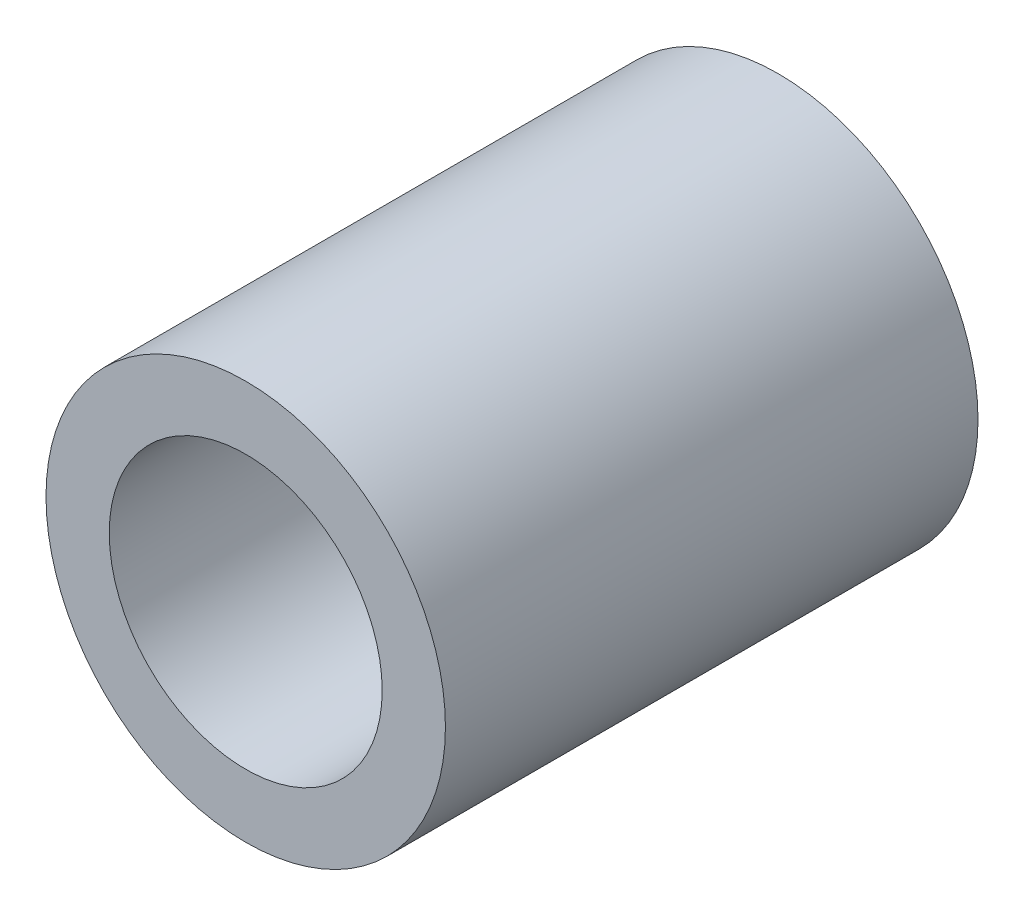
ISO-10303-21;
HEADER;
FILE_DESCRIPTION(('STEP AP214'),'2;1');
FILE_NAME('part.step','',(''),(''),'','','');
FILE_SCHEMA(('AUTOMOTIVE_DESIGN { 1 0 10303 214 1 1 1 1 }'));
ENDSEC;
DATA;
#1=APPLICATION_CONTEXT('core data for automotive mechanical design processes');
#2=APPLICATION_PROTOCOL_DEFINITION('international standard','automotive_design',2000,#1);
#3=PRODUCT_CONTEXT('',#1,'mechanical');
#4=PRODUCT('Part','Part','',(#3));
#5=PRODUCT_RELATED_PRODUCT_CATEGORY('part','',(#4));
#6=PRODUCT_DEFINITION_FORMATION('','',#4);
#7=PRODUCT_DEFINITION_CONTEXT('part definition',#1,'design');
#8=PRODUCT_DEFINITION('design','',#6,#7);
#9=PRODUCT_DEFINITION_SHAPE('','',#8);
#10=(LENGTH_UNIT() NAMED_UNIT(*) SI_UNIT(.MILLI.,.METRE.));
#11=(NAMED_UNIT(*) PLANE_ANGLE_UNIT() SI_UNIT($,.RADIAN.));
#12=(NAMED_UNIT(*) SI_UNIT($,.STERADIAN.) SOLID_ANGLE_UNIT());
#13=UNCERTAINTY_MEASURE_WITH_UNIT(LENGTH_MEASURE(1.E-05),#10,'distance_accuracy_value','');
#14=(GEOMETRIC_REPRESENTATION_CONTEXT(3) GLOBAL_UNCERTAINTY_ASSIGNED_CONTEXT((#13)) GLOBAL_UNIT_ASSIGNED_CONTEXT((#10,
#11,#12)) REPRESENTATION_CONTEXT('',''));
#15=CARTESIAN_POINT('',(0.,0.,0.));
#16=DIRECTION('',(0.,0.,1.));
#17=DIRECTION('',(1.,0.,0.));
#18=AXIS2_PLACEMENT_3D('',#15,#16,#17);
#19=CARTESIAN_POINT('',(0.,0.,40.));
#20=DIRECTION('',(0.,0.,1.));
#21=DIRECTION('',(1.,0.,0.));
#22=AXIS2_PLACEMENT_3D('',#19,#20,#21);
#23=PLANE('',#22);
#24=CARTESIAN_POINT('',(0.,0.,40.));
#25=DIRECTION('',(0.,0.,1.));
#26=DIRECTION('',(1.,0.,0.));
#27=AXIS2_PLACEMENT_3D('',#24,#25,#26);
#28=CIRCLE('',#27,15.);
#29=CARTESIAN_POINT('',(15.,0.,40.));
#30=VERTEX_POINT('',#29);
#31=EDGE_CURVE('E10',#30,#30,#28,.T.);
#32=ORIENTED_EDGE('',*,*,#31,.T.);
#33=EDGE_LOOP('',(#32));
#34=FACE_BOUND('',#33,.T.);
#35=CARTESIAN_POINT('',(0.,0.,40.));
#36=DIRECTION('',(0.,0.,1.));
#37=DIRECTION('',(1.,0.,0.));
#38=AXIS2_PLACEMENT_3D('',#35,#36,#37);
#39=CIRCLE('',#38,10.25);
#40=CARTESIAN_POINT('',(10.25,0.,40.));
#41=VERTEX_POINT('',#40);
#42=EDGE_CURVE('E44',#41,#41,#39,.T.);
#43=ORIENTED_EDGE('',*,*,#42,.F.);
#44=EDGE_LOOP('',(#43));
#45=FACE_BOUND('',#44,.T.);
#46=ADVANCED_FACE('F27',(#34,#45),#23,.T.);
#47=CARTESIAN_POINT('',(0.,0.,0.));
#48=DIRECTION('',(0.,0.,1.));
#49=DIRECTION('',(1.,0.,0.));
#50=AXIS2_PLACEMENT_3D('',#47,#48,#49);
#51=PLANE('',#50);
#52=CARTESIAN_POINT('',(0.,0.,0.));
#53=DIRECTION('',(0.,0.,1.));
#54=DIRECTION('',(1.,0.,0.));
#55=AXIS2_PLACEMENT_3D('',#52,#53,#54);
#56=CIRCLE('',#55,15.);
#57=CARTESIAN_POINT('',(15.,0.,0.));
#58=VERTEX_POINT('',#57);
#59=EDGE_CURVE('E40',#58,#58,#56,.T.);
#60=ORIENTED_EDGE('',*,*,#59,.F.);
#61=EDGE_LOOP('',(#60));
#62=FACE_BOUND('',#61,.T.);
#63=CARTESIAN_POINT('',(0.,0.,0.));
#64=DIRECTION('',(0.,0.,1.));
#65=DIRECTION('',(1.,0.,0.));
#66=AXIS2_PLACEMENT_3D('',#63,#64,#65);
#67=CIRCLE('',#66,10.25);
#68=CARTESIAN_POINT('',(10.25,0.,0.));
#69=VERTEX_POINT('',#68);
#70=EDGE_CURVE('E49',#69,#69,#67,.T.);
#71=ORIENTED_EDGE('',*,*,#70,.T.);
#72=EDGE_LOOP('',(#71));
#73=FACE_BOUND('',#72,.T.);
#74=ADVANCED_FACE('F66',(#62,#73),#51,.F.);
#75=CARTESIAN_POINT('',(0.,0.,40.));
#76=DIRECTION('',(0.,0.,-1.));
#77=DIRECTION('',(-1.,0.,0.));
#78=AXIS2_PLACEMENT_3D('',#75,#76,#77);
#79=CYLINDRICAL_SURFACE('',#78,15.);
#80=CARTESIAN_POINT('',(0.,-15.,23.));
#81=CARTESIAN_POINT('',(0.1667307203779,-14.9999969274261,22.999993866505));
#82=CARTESIAN_POINT('',(0.333538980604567,-14.9971915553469,22.9860534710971));
#83=CARTESIAN_POINT('',(0.662440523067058,-14.9862709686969,22.9307044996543));
#84=CARTESIAN_POINT('',(0.824529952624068,-14.9781515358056,22.8892741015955));
#85=CARTESIAN_POINT('',(1.13919091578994,-14.9575094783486,22.7802761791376));
#86=CARTESIAN_POINT('',(1.2917714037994,-14.9449910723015,22.7127336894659));
#87=CARTESIAN_POINT('',(1.58342396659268,-14.9169119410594,22.5535032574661));
#88=CARTESIAN_POINT('',(1.72249684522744,-14.9013513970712,22.4618167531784));
#89=CARTESIAN_POINT('',(1.9850804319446,-14.8686649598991,22.2555845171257));
#90=CARTESIAN_POINT('',(2.10838185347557,-14.8515223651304,22.1407749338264));
#91=CARTESIAN_POINT('',(2.33411026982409,-14.8177254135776,21.8921227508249));
#92=CARTESIAN_POINT('',(2.43653563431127,-14.8010710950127,21.7582786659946));
#93=CARTESIAN_POINT('',(2.61849526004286,-14.7699732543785,21.4738514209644));
#94=CARTESIAN_POINT('',(2.6978128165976,-14.7555512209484,21.3231270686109));
#95=CARTESIAN_POINT('',(2.82991699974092,-14.7307880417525,21.0101545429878));
#96=CARTESIAN_POINT('',(2.88270624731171,-14.7204464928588,20.847907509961));
#97=CARTESIAN_POINT('',(2.95957589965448,-14.7051841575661,20.5187469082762));
#98=CARTESIAN_POINT('',(2.98402349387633,-14.7001941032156,20.3519223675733));
#99=CARTESIAN_POINT('',(3.00465638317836,-14.6959912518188,20.016470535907));
#100=CARTESIAN_POINT('',(3.0008445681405,-14.6967778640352,19.8478434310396));
#101=CARTESIAN_POINT('',(2.96536371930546,-14.7039765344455,19.516259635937));
#102=CARTESIAN_POINT('',(2.93411562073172,-14.7103035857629,19.3532557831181));
#103=CARTESIAN_POINT('',(2.84531365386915,-14.7277363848,19.034851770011));
#104=CARTESIAN_POINT('',(2.78775852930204,-14.7388423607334,18.879451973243));
#105=CARTESIAN_POINT('',(2.64757435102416,-14.7646685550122,18.5794542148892));
#106=CARTESIAN_POINT('',(2.56477845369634,-14.7794126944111,18.4349363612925));
#107=CARTESIAN_POINT('',(2.37658072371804,-14.8108385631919,18.1616874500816));
#108=CARTESIAN_POINT('',(2.27117629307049,-14.827520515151,18.0329582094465));
#109=CARTESIAN_POINT('',(2.03849980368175,-14.8613106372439,17.7925117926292));
#110=CARTESIAN_POINT('',(1.91086848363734,-14.8784210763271,17.6811422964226));
#111=CARTESIAN_POINT('',(1.63855507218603,-14.9108654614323,17.4813384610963));
#112=CARTESIAN_POINT('',(1.49387276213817,-14.9261993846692,17.3929044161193));
#113=CARTESIAN_POINT('',(1.19117816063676,-14.9534007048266,17.2414174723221));
#114=CARTESIAN_POINT('',(1.0331454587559,-14.9652626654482,17.1784043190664));
#115=CARTESIAN_POINT('',(0.708446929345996,-14.9841422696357,17.0799185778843));
#116=CARTESIAN_POINT('',(0.54178215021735,-14.9911605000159,17.0444426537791));
#117=CARTESIAN_POINT('',(0.207538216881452,-14.999480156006,17.0025306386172));
#118=CARTESIAN_POINT('',(0.0400209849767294,-15.0008752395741,16.9956187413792));
#119=CARTESIAN_POINT('',(-0.293774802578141,-14.9980515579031,17.0097495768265));
#120=CARTESIAN_POINT('',(-0.460053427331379,-14.9938331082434,17.0307907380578));
#121=CARTESIAN_POINT('',(-0.785116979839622,-14.9803149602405,17.0998351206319));
#122=CARTESIAN_POINT('',(-0.943955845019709,-14.9710612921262,17.1475942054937));
#123=CARTESIAN_POINT('',(-1.251370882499,-14.948506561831,17.2684519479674));
#124=CARTESIAN_POINT('',(-1.39994628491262,-14.9352051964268,17.3415525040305));
#125=CARTESIAN_POINT('',(-1.68462352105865,-14.9057973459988,17.5120474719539));
#126=CARTESIAN_POINT('',(-1.82055038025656,-14.8896585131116,17.6097283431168));
#127=CARTESIAN_POINT('',(-2.07425405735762,-14.8564420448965,17.8262275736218));
#128=CARTESIAN_POINT('',(-2.19202892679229,-14.8393643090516,17.9450481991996));
#129=CARTESIAN_POINT('',(-2.40792177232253,-14.8058791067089,18.2026200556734));
#130=CARTESIAN_POINT('',(-2.50571310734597,-14.7894858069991,18.341647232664));
#131=CARTESIAN_POINT('',(-2.67655626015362,-14.7595257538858,18.63443408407));
#132=CARTESIAN_POINT('',(-2.74960906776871,-14.7459588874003,18.7881931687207));
#133=CARTESIAN_POINT('',(-2.86845552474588,-14.7233022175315,19.1053047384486));
#134=CARTESIAN_POINT('',(-2.91439049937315,-14.7141892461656,19.2686025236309));
#135=CARTESIAN_POINT('',(-2.97812595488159,-14.7014231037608,19.6008003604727));
#136=CARTESIAN_POINT('',(-2.99593010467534,-14.6977692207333,19.769699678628));
#137=CARTESIAN_POINT('',(-3.00276273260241,-14.6963744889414,20.105026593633));
#138=CARTESIAN_POINT('',(-2.99230736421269,-14.698527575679,20.271443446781));
#139=CARTESIAN_POINT('',(-2.94405691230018,-14.7082672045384,20.6000949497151));
#140=CARTESIAN_POINT('',(-2.9062620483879,-14.7158537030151,20.7623296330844));
#141=CARTESIAN_POINT('',(-2.80463570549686,-14.7355579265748,21.0776831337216));
#142=CARTESIAN_POINT('',(-2.74086752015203,-14.7476646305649,21.2308230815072));
#143=CARTESIAN_POINT('',(-2.58916393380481,-14.7750514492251,21.5243111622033));
#144=CARTESIAN_POINT('',(-2.50122650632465,-14.7903318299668,21.6646582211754));
#145=CARTESIAN_POINT('',(-2.30191774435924,-14.8226688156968,21.9311467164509));
#146=CARTESIAN_POINT('',(-2.19017366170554,-14.839751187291,22.0570062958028));
#147=CARTESIAN_POINT('',(-1.94719310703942,-14.8735824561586,22.2883586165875));
#148=CARTESIAN_POINT('',(-1.81595216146,-14.8903312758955,22.3938466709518));
#149=CARTESIAN_POINT('',(-1.53605288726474,-14.9218149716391,22.5825039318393));
#150=CARTESIAN_POINT('',(-1.3872266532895,-14.9365269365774,22.6654280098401));
#151=CARTESIAN_POINT('',(-1.0774990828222,-14.96205375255,22.8049583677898));
#152=CARTESIAN_POINT('',(-0.916608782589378,-14.9728721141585,22.8615883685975));
#153=CARTESIAN_POINT('',(-0.629464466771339,-14.9872911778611,22.9359558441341));
#154=CARTESIAN_POINT('',(-0.504844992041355,-14.9920290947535,22.9599295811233));
#155=CARTESIAN_POINT('',(-0.253498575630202,-14.9983846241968,22.9919537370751));
#156=CARTESIAN_POINT('',(-0.126771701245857,-15.0000023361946,23.0000046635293));
#157=CARTESIAN_POINT('',(0.,-15.,23.));
#158=B_SPLINE_CURVE_WITH_KNOTS('',3,(#80,#81,#82,#83,#84,#85,#86,#87,#88,#89,#90,#91,#92,#93,
#94,#95,#96,#97,#98,#99,#100,#101,#102,#103,#104,#105,#106,#107,#108,#109,#110,#111,#112,#113,
#114,#115,#116,#117,#118,#119,#120,#121,#122,#123,#124,#125,#126,#127,#128,#129,#130,#131,#132,
#133,#134,#135,#136,#137,#138,#139,#140,#141,#142,#143,#144,#145,#146,#147,#148,#149,#150,#151,
#152,#153,#154,#155,#156,#157),.UNSPECIFIED.,.T.,.F.,(4,2,2,2,2,2,2,2,2,2,2,2,2,2,2,2,2,2,2,2,2,
2,2,2,2,2,2,2,2,2,2,2,2,2,2,2,2,2,4),(0.,0.499728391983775,0.999853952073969,1.49950120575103,
1.99911870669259,2.50479801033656,3.0105167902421,3.52083585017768,4.03110448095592,
4.53468555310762,5.03821512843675,5.53415181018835,6.03011217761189,6.52942470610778,
7.02879464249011,7.53714757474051,8.0455070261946,8.55465824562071,9.06374777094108,
9.56432207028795,10.064868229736,10.5609136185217,11.0569961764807,11.5591519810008,
12.0613616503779,12.5712188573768,13.081055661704,13.5882114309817,14.0953010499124,
14.593191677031,15.0910783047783,15.5877588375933,16.084481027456,16.5896422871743,
17.0949196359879,17.6054849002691,18.1155886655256,18.4955632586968,18.8755257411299),.UNSPECIFIED.);
#159=CARTESIAN_POINT('',(0.,-15.,23.));
#160=VERTEX_POINT('',#159);
#161=EDGE_CURVE('E52',#160,#160,#158,.T.);
#162=ORIENTED_EDGE('',*,*,#161,.T.);
#163=EDGE_LOOP('',(#162));
#164=FACE_BOUND('',#163,.T.);
#165=ORIENTED_EDGE('',*,*,#31,.F.);
#166=EDGE_LOOP('',(#165));
#167=FACE_BOUND('',#166,.T.);
#168=ORIENTED_EDGE('',*,*,#59,.T.);
#169=EDGE_LOOP('',(#168));
#170=FACE_BOUND('',#169,.T.);
#171=ADVANCED_FACE('F29',(#164,#167,#170),#79,.T.);
#172=CARTESIAN_POINT('',(0.,0.,40.));
#173=DIRECTION('',(0.,0.,-1.));
#174=DIRECTION('',(-1.,0.,0.));
#175=AXIS2_PLACEMENT_3D('',#172,#173,#174);
#176=CYLINDRICAL_SURFACE('',#175,10.25);
#177=CARTESIAN_POINT('',(0.,-10.25,23.));
#178=CARTESIAN_POINT('',(0.164761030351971,-10.2499982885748,22.9999975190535));
#179=CARTESIAN_POINT('',(0.329547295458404,-10.2459891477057,22.9863817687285));
#180=CARTESIAN_POINT('',(0.654332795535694,-10.230386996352,22.9324001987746));
#181=CARTESIAN_POINT('',(0.814330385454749,-10.2187914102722,22.8920252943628));
#182=CARTESIAN_POINT('',(1.12480632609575,-10.1892890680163,22.7859804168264));
#183=CARTESIAN_POINT('',(1.27529796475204,-10.1713913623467,22.7203467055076));
#184=CARTESIAN_POINT('',(1.56313982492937,-10.1311520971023,22.5657928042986));
#185=CARTESIAN_POINT('',(1.70048848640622,-10.1088100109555,22.4768698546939));
#186=CARTESIAN_POINT('',(1.96191733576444,-10.0613857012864,22.2756873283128));
#187=CARTESIAN_POINT('',(2.08558550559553,-10.0362493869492,22.1629051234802));
#188=CARTESIAN_POINT('',(2.31255048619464,-9.98639778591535,21.9183201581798));
#189=CARTESIAN_POINT('',(2.41584406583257,-9.96168256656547,21.7865143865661));
#190=CARTESIAN_POINT('',(2.60125899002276,-9.91490371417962,21.5041829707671));
#191=CARTESIAN_POINT('',(2.68288409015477,-9.89290754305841,21.3533192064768));
#192=CARTESIAN_POINT('',(2.81943980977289,-9.85486275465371,21.039259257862));
#193=CARTESIAN_POINT('',(2.87437649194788,-9.83881278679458,20.8760658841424));
#194=CARTESIAN_POINT('',(2.95452269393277,-9.81504013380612,20.5465920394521));
#195=CARTESIAN_POINT('',(2.98048902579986,-9.80710592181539,20.380511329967));
#196=CARTESIAN_POINT('',(3.00431990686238,-9.79983320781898,20.0461759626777));
#197=CARTESIAN_POINT('',(3.00219089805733,-9.80049273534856,19.8779218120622));
#198=CARTESIAN_POINT('',(2.97048742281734,-9.81014508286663,19.5501118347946));
#199=CARTESIAN_POINT('',(2.94185346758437,-9.81885231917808,19.3904552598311));
#200=CARTESIAN_POINT('',(2.85946944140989,-9.8431580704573,19.0783189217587));
#201=CARTESIAN_POINT('',(2.80571699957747,-9.85875723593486,18.9258398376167));
#202=CARTESIAN_POINT('',(2.67391255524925,-9.89532234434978,18.630052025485));
#203=CARTESIAN_POINT('',(2.59554994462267,-9.91635624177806,18.4868904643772));
#204=CARTESIAN_POINT('',(2.41696561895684,-9.9613872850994,18.2154303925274));
#205=CARTESIAN_POINT('',(2.31673882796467,-9.98538511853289,18.0871353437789));
#206=CARTESIAN_POINT('',(2.09256856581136,-10.0348053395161,17.8437063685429));
#207=CARTESIAN_POINT('',(1.96784238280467,-10.0602464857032,17.7292958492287));
#208=CARTESIAN_POINT('',(1.70065773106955,-10.1088414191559,17.5228512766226));
#209=CARTESIAN_POINT('',(1.55819825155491,-10.1319950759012,17.4308184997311));
#210=CARTESIAN_POINT('',(1.25832091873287,-10.1736007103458,17.271330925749));
#211=CARTESIAN_POINT('',(1.10081695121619,-10.1920230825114,17.2040298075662));
#212=CARTESIAN_POINT('',(0.776062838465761,-10.2218771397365,17.0970823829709));
#213=CARTESIAN_POINT('',(0.608815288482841,-10.2333106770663,17.0574287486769));
#214=CARTESIAN_POINT('',(0.275476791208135,-10.2476087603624,17.0080905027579));
#215=CARTESIAN_POINT('',(0.109542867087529,-10.2507537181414,16.9974247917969));
#216=CARTESIAN_POINT('',(-0.221751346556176,-10.2489391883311,17.003624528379));
#217=CARTESIAN_POINT('',(-0.387111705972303,-10.2439807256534,17.020486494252));
#218=CARTESIAN_POINT('',(-0.708907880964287,-10.2266995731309,17.0804667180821));
#219=CARTESIAN_POINT('',(-0.865458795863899,-10.2145361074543,17.1230176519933));
#220=CARTESIAN_POINT('',(-1.16917031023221,-10.1842453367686,17.2324908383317));
#221=CARTESIAN_POINT('',(-1.31632979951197,-10.1661173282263,17.2994159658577));
#222=CARTESIAN_POINT('',(-1.60073763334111,-10.1252781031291,17.4574236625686));
#223=CARTESIAN_POINT('',(-1.7376904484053,-10.1024733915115,17.5490133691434));
#224=CARTESIAN_POINT('',(-1.99461950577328,-10.0549039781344,17.7531294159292));
#225=CARTESIAN_POINT('',(-2.11459168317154,-10.0301388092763,17.8656607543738));
#226=CARTESIAN_POINT('',(-2.33843282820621,-9.98037315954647,18.113070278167));
#227=CARTESIAN_POINT('',(-2.44160478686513,-9.95539395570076,18.2485846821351));
#228=CARTESIAN_POINT('',(-2.62378498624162,-9.90894158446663,18.5355442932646));
#229=CARTESIAN_POINT('',(-2.70279397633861,-9.88746830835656,18.6869890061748));
#230=CARTESIAN_POINT('',(-2.83384433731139,-9.85070881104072,19.0009476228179));
#231=CARTESIAN_POINT('',(-2.88602104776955,-9.83539162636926,19.1634012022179));
#232=CARTESIAN_POINT('',(-2.9621376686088,-9.81273906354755,19.4953159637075));
#233=CARTESIAN_POINT('',(-2.98608666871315,-9.80540111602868,19.6647748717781));
#234=CARTESIAN_POINT('',(-3.00447077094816,-9.79978244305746,19.9986741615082));
#235=CARTESIAN_POINT('',(-3.00003820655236,-9.80115420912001,20.1630471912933));
#236=CARTESIAN_POINT('',(-2.96447047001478,-9.81196987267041,20.4885940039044));
#237=CARTESIAN_POINT('',(-2.93333627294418,-9.82141347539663,20.6497679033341));
#238=CARTESIAN_POINT('',(-2.8459639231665,-9.84708138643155,20.9625882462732));
#239=CARTESIAN_POINT('',(-2.79001188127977,-9.8632282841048,21.1143214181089));
#240=CARTESIAN_POINT('',(-2.65481394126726,-9.90047257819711,21.4063673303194));
#241=CARTESIAN_POINT('',(-2.57556375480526,-9.92157088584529,21.5466779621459));
#242=CARTESIAN_POINT('',(-2.39278153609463,-9.96725898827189,21.8171853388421));
#243=CARTESIAN_POINT('',(-2.28849929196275,-9.99194486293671,21.9468589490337));
#244=CARTESIAN_POINT('',(-2.05998084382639,-10.0415451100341,22.1872335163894));
#245=CARTESIAN_POINT('',(-1.93573954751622,-10.0664595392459,22.297929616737));
#246=CARTESIAN_POINT('',(-1.66673369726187,-10.11452652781,22.5002165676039));
#247=CARTESIAN_POINT('',(-1.52150065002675,-10.1376122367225,22.5912018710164));
#248=CARTESIAN_POINT('',(-1.21712309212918,-10.1786359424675,22.7473316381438));
#249=CARTESIAN_POINT('',(-1.05798571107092,-10.1965765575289,22.812489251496));
#250=CARTESIAN_POINT('',(-0.750037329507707,-10.2235467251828,22.9086533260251));
#251=CARTESIAN_POINT('',(-0.602277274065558,-10.2333870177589,22.9428186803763));
#252=CARTESIAN_POINT('',(-0.303018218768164,-10.2466139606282,22.9884914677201));
#253=CARTESIAN_POINT('',(-0.151519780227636,-10.2500015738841,23.0000022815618));
#254=CARTESIAN_POINT('',(0.,-10.25,23.));
#255=B_SPLINE_CURVE_WITH_KNOTS('',3,(#177,#178,#179,#180,#181,#182,#183,#184,#185,#186,#187,
#188,#189,#190,#191,#192,#193,#194,#195,#196,#197,#198,#199,#200,#201,#202,#203,#204,#205,#206,
#207,#208,#209,#210,#211,#212,#213,#214,#215,#216,#217,#218,#219,#220,#221,#222,#223,#224,#225,
#226,#227,#228,#229,#230,#231,#232,#233,#234,#235,#236,#237,#238,#239,#240,#241,#242,#243,#244,
#245,#246,#247,#248,#249,#250,#251,#252,#253,#254),.UNSPECIFIED.,.T.,.F.,(4,2,2,2,2,2,2,2,2,2,2,
2,2,2,2,2,2,2,2,2,2,2,2,2,2,2,2,2,2,2,2,2,2,2,2,2,2,2,4),(0.,0.493726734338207,
0.987621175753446,1.48080920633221,1.97405570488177,2.47949748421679,2.98501935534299,
3.50127745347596,4.01741822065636,4.51973447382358,5.02193555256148,5.50697252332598,
5.99205528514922,6.48352459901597,6.9751081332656,7.48618028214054,7.99728157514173,
8.51150712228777,9.02559632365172,9.52205577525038,10.0184524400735,10.504268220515,
10.9901413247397,11.4868885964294,11.9837545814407,12.4977349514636,13.011699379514,
13.5230453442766,14.0342266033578,14.5251440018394,15.0160434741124,15.5014250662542,
15.9868960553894,16.4892919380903,16.991816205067,17.5080888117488,18.0240982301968,
18.4782137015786,18.9322613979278),.UNSPECIFIED.);
#256=CARTESIAN_POINT('',(0.,-10.25,23.));
#257=VERTEX_POINT('',#256);
#258=EDGE_CURVE('E32',#257,#257,#255,.T.);
#259=ORIENTED_EDGE('',*,*,#258,.F.);
#260=EDGE_LOOP('',(#259));
#261=FACE_BOUND('',#260,.T.);
#262=ORIENTED_EDGE('',*,*,#42,.T.);
#263=EDGE_LOOP('',(#262));
#264=FACE_BOUND('',#263,.T.);
#265=ORIENTED_EDGE('',*,*,#70,.F.);
#266=EDGE_LOOP('',(#265));
#267=FACE_BOUND('',#266,.T.);
#268=ADVANCED_FACE('F59',(#261,#264,#267),#176,.F.);
#269=CARTESIAN_POINT('',(0.,-20.,20.));
#270=DIRECTION('',(0.,1.,0.));
#271=DIRECTION('',(0.,0.,1.));
#272=AXIS2_PLACEMENT_3D('',#269,#270,#271);
#273=CYLINDRICAL_SURFACE('',#272,3.);
#274=ORIENTED_EDGE('',*,*,#258,.T.);
#275=EDGE_LOOP('',(#274));
#276=FACE_BOUND('',#275,.T.);
#277=ORIENTED_EDGE('',*,*,#161,.F.);
#278=EDGE_LOOP('',(#277));
#279=FACE_BOUND('',#278,.T.);
#280=ADVANCED_FACE('F56',(#276,#279),#273,.F.);
#281=CLOSED_SHELL('',(#46,#74,#171,#268,#280));
#282=MANIFOLD_SOLID_BREP('B2',#281);
#283=ADVANCED_BREP_SHAPE_REPRESENTATION('',(#18,#282),#14);
#284=SHAPE_DEFINITION_REPRESENTATION(#9,#283);
ENDSEC;
END-ISO-10303-21;
